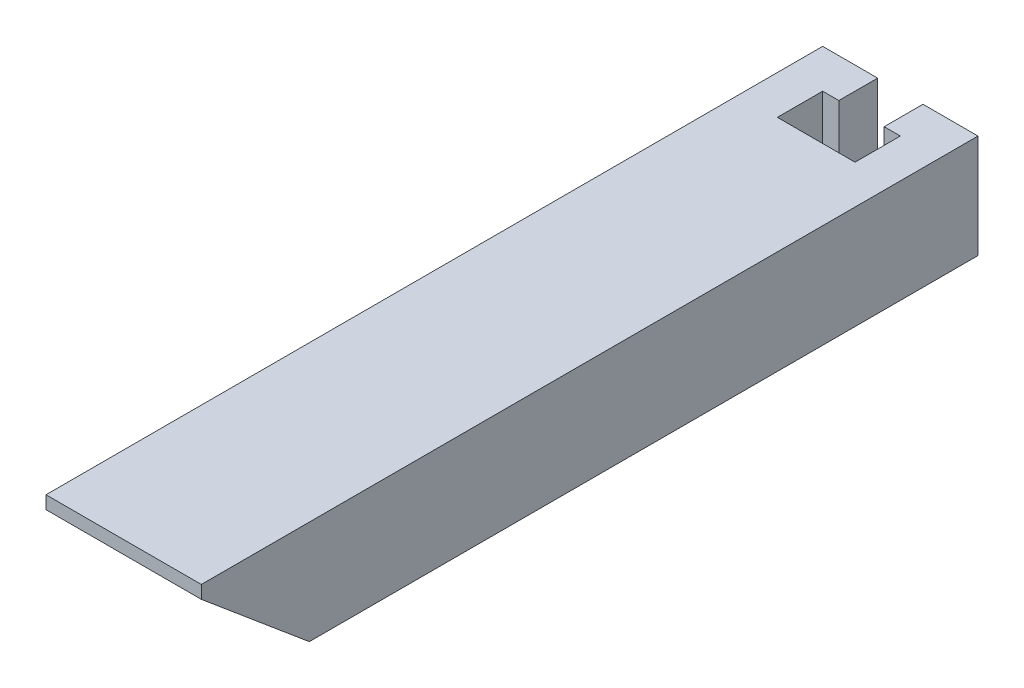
ISO-10303-21;
HEADER;
FILE_DESCRIPTION(('STEP AP214'),'2;1');
FILE_NAME('part.step','',(''),(''),'','','');
FILE_SCHEMA(('AUTOMOTIVE_DESIGN { 1 0 10303 214 1 1 1 1 }'));
ENDSEC;
DATA;
#1=APPLICATION_CONTEXT('core data for automotive mechanical design processes');
#2=APPLICATION_PROTOCOL_DEFINITION('international standard','automotive_design',2000,#1);
#3=PRODUCT_CONTEXT('',#1,'mechanical');
#4=PRODUCT('Part','Part','',(#3));
#5=PRODUCT_RELATED_PRODUCT_CATEGORY('part','',(#4));
#6=PRODUCT_DEFINITION_FORMATION('','',#4);
#7=PRODUCT_DEFINITION_CONTEXT('part definition',#1,'design');
#8=PRODUCT_DEFINITION('design','',#6,#7);
#9=PRODUCT_DEFINITION_SHAPE('','',#8);
#10=(LENGTH_UNIT() NAMED_UNIT(*) SI_UNIT(.MILLI.,.METRE.));
#11=(NAMED_UNIT(*) PLANE_ANGLE_UNIT() SI_UNIT($,.RADIAN.));
#12=(NAMED_UNIT(*) SI_UNIT($,.STERADIAN.) SOLID_ANGLE_UNIT());
#13=UNCERTAINTY_MEASURE_WITH_UNIT(LENGTH_MEASURE(1.E-05),#10,'distance_accuracy_value','');
#14=(GEOMETRIC_REPRESENTATION_CONTEXT(3) GLOBAL_UNCERTAINTY_ASSIGNED_CONTEXT((#13)) GLOBAL_UNIT_ASSIGNED_CONTEXT((#10,
#11,#12)) REPRESENTATION_CONTEXT('',''));
#15=CARTESIAN_POINT('',(0.,0.,0.));
#16=DIRECTION('',(0.,0.,1.));
#17=DIRECTION('',(1.,0.,0.));
#18=AXIS2_PLACEMENT_3D('',#15,#16,#17);
#19=CARTESIAN_POINT('',(0.,0.,60.));
#20=DIRECTION('',(0.,1.,0.));
#21=DIRECTION('',(0.,0.,1.));
#22=AXIS2_PLACEMENT_3D('',#19,#20,#21);
#23=PLANE('',#22);
#24=DIRECTION('',(6.06285854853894E-13,0.,-1.));
#25=VECTOR('',#24,1.);
#26=CARTESIAN_POINT('',(4.24999999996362,0.,60.0000000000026));
#27=LINE('',#26,#25);
#28=CARTESIAN_POINT('',(4.24999999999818,0.,3.));
#29=VERTEX_POINT('',#28);
#30=CARTESIAN_POINT('',(4.25,0.,0.));
#31=VERTEX_POINT('',#30);
#32=EDGE_CURVE('E175',#29,#31,#27,.T.);
#33=ORIENTED_EDGE('',*,*,#32,.F.);
#34=DIRECTION('',(1.,0.,0.));
#35=VECTOR('',#34,1.);
#36=CARTESIAN_POINT('',(0.,0.,3.));
#37=LINE('',#36,#35);
#38=CARTESIAN_POINT('',(3.,0.,3.));
#39=VERTEX_POINT('',#38);
#40=EDGE_CURVE('E185',#39,#29,#37,.T.);
#41=ORIENTED_EDGE('',*,*,#40,.F.);
#42=DIRECTION('',(0.,0.,-1.));
#43=VECTOR('',#42,1.);
#44=CARTESIAN_POINT('',(3.,0.,60.));
#45=LINE('',#44,#43);
#46=CARTESIAN_POINT('',(3.,0.,6.5));
#47=VERTEX_POINT('',#46);
#48=EDGE_CURVE('E183',#47,#39,#45,.T.);
#49=ORIENTED_EDGE('',*,*,#48,.F.);
#50=DIRECTION('',(-1.,0.,0.));
#51=VECTOR('',#50,1.);
#52=CARTESIAN_POINT('',(0.,0.,6.5));
#53=LINE('',#52,#51);
#54=CARTESIAN_POINT('',(9.,0.,6.5));
#55=VERTEX_POINT('',#54);
#56=EDGE_CURVE('E181',#55,#47,#53,.T.);
#57=ORIENTED_EDGE('',*,*,#56,.F.);
#58=DIRECTION('',(0.,0.,1.));
#59=VECTOR('',#58,1.);
#60=CARTESIAN_POINT('',(9.,0.,60.));
#61=LINE('',#60,#59);
#62=CARTESIAN_POINT('',(9.,0.,3.));
#63=VERTEX_POINT('',#62);
#64=EDGE_CURVE('E179',#63,#55,#61,.T.);
#65=ORIENTED_EDGE('',*,*,#64,.F.);
#66=DIRECTION('',(1.,0.,0.));
#67=VECTOR('',#66,1.);
#68=CARTESIAN_POINT('',(0.,0.,3.));
#69=LINE('',#68,#67);
#70=CARTESIAN_POINT('',(7.75,0.,3.));
#71=VERTEX_POINT('',#70);
#72=EDGE_CURVE('E177',#71,#63,#69,.T.);
#73=ORIENTED_EDGE('',*,*,#72,.F.);
#74=DIRECTION('',(0.,0.,1.));
#75=VECTOR('',#74,1.);
#76=CARTESIAN_POINT('',(7.75,0.,60.));
#77=LINE('',#76,#75);
#78=CARTESIAN_POINT('',(7.75,0.,0.));
#79=VERTEX_POINT('',#78);
#80=EDGE_CURVE('E131',#79,#71,#77,.T.);
#81=ORIENTED_EDGE('',*,*,#80,.F.);
#82=DIRECTION('',(1.,0.,0.));
#83=VECTOR('',#82,1.);
#84=CARTESIAN_POINT('',(0.,0.,0.));
#85=LINE('',#84,#83);
#86=CARTESIAN_POINT('',(12.,0.,0.));
#87=VERTEX_POINT('',#86);
#88=EDGE_CURVE('E203',#79,#87,#85,.T.);
#89=ORIENTED_EDGE('',*,*,#88,.T.);
#90=DIRECTION('',(0.,0.,-1.));
#91=VECTOR('',#90,1.);
#92=CARTESIAN_POINT('',(12.,0.,60.));
#93=LINE('',#92,#91);
#94=CARTESIAN_POINT('',(12.,-1.13583191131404E-13,51.6577248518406));
#95=VERTEX_POINT('',#94);
#96=EDGE_CURVE('E215',#95,#87,#93,.T.);
#97=ORIENTED_EDGE('',*,*,#96,.F.);
#98=DIRECTION('',(1.,0.,0.));
#99=VECTOR('',#98,1.);
#100=CARTESIAN_POINT('',(-48.,-1.13686837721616E-13,51.6577248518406));
#101=LINE('',#100,#99);
#102=CARTESIAN_POINT('',(0.,-1.13686837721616E-13,51.6577248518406));
#103=VERTEX_POINT('',#102);
#104=EDGE_CURVE('E188',#103,#95,#101,.T.);
#105=ORIENTED_EDGE('',*,*,#104,.F.);
#106=DIRECTION('',(0.,0.,-1.));
#107=VECTOR('',#106,1.);
#108=CARTESIAN_POINT('',(0.,0.,60.));
#109=LINE('',#108,#107);
#110=CARTESIAN_POINT('',(0.,0.,0.));
#111=VERTEX_POINT('',#110);
#112=EDGE_CURVE('E218',#103,#111,#109,.T.);
#113=ORIENTED_EDGE('',*,*,#112,.T.);
#114=EDGE_CURVE('E204',#111,#31,#85,.T.);
#115=ORIENTED_EDGE('',*,*,#114,.T.);
#116=EDGE_LOOP('',(#33,#41,#49,#57,#65,#73,#81,#89,#97,#105,#113,#115));
#117=FACE_BOUND('',#116,.T.);
#118=ADVANCED_FACE('F34',(#117),#23,.F.);
#119=CARTESIAN_POINT('',(0.,8.,60.));
#120=DIRECTION('',(0.,-1.,0.));
#121=DIRECTION('',(0.,0.,-1.));
#122=AXIS2_PLACEMENT_3D('',#119,#120,#121);
#123=PLANE('',#122);
#124=DIRECTION('',(6.06285854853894E-13,0.,-1.));
#125=VECTOR('',#124,1.);
#126=CARTESIAN_POINT('',(4.24999999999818,8.,3.));
#127=LINE('',#126,#125);
#128=CARTESIAN_POINT('',(4.24999999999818,8.,3.));
#129=VERTEX_POINT('',#128);
#130=CARTESIAN_POINT('',(4.25,8.,0.));
#131=VERTEX_POINT('',#130);
#132=EDGE_CURVE('E135',#129,#131,#127,.T.);
#133=ORIENTED_EDGE('',*,*,#132,.T.);
#134=DIRECTION('',(-1.,0.,0.));
#135=VECTOR('',#134,1.);
#136=CARTESIAN_POINT('',(0.,8.,0.));
#137=LINE('',#136,#135);
#138=CARTESIAN_POINT('',(0.,8.,0.));
#139=VERTEX_POINT('',#138);
#140=EDGE_CURVE('E209',#131,#139,#137,.T.);
#141=ORIENTED_EDGE('',*,*,#140,.T.);
#142=DIRECTION('',(0.,0.,-1.));
#143=VECTOR('',#142,1.);
#144=CARTESIAN_POINT('',(0.,8.,60.));
#145=LINE('',#144,#143);
#146=CARTESIAN_POINT('',(0.,8.,60.));
#147=VERTEX_POINT('',#146);
#148=EDGE_CURVE('E200',#147,#139,#145,.T.);
#149=ORIENTED_EDGE('',*,*,#148,.F.);
#150=DIRECTION('',(-1.,0.,0.));
#151=VECTOR('',#150,1.);
#152=CARTESIAN_POINT('',(0.,8.,60.));
#153=LINE('',#152,#151);
#154=CARTESIAN_POINT('',(12.,8.,60.));
#155=VERTEX_POINT('',#154);
#156=EDGE_CURVE('E198',#155,#147,#153,.T.);
#157=ORIENTED_EDGE('',*,*,#156,.F.);
#158=DIRECTION('',(0.,0.,-1.));
#159=VECTOR('',#158,1.);
#160=CARTESIAN_POINT('',(12.,8.,60.));
#161=LINE('',#160,#159);
#162=CARTESIAN_POINT('',(12.,8.,0.));
#163=VERTEX_POINT('',#162);
#164=EDGE_CURVE('E213',#155,#163,#161,.T.);
#165=ORIENTED_EDGE('',*,*,#164,.T.);
#166=CARTESIAN_POINT('',(7.75,8.,0.));
#167=VERTEX_POINT('',#166);
#168=EDGE_CURVE('E151',#163,#167,#137,.T.);
#169=ORIENTED_EDGE('',*,*,#168,.T.);
#170=DIRECTION('',(0.,0.,1.));
#171=VECTOR('',#170,1.);
#172=CARTESIAN_POINT('',(7.75,8.,3.));
#173=LINE('',#172,#171);
#174=CARTESIAN_POINT('',(7.75,8.,3.));
#175=VERTEX_POINT('',#174);
#176=EDGE_CURVE('E49',#167,#175,#173,.T.);
#177=ORIENTED_EDGE('',*,*,#176,.T.);
#178=DIRECTION('',(1.,0.,0.));
#179=VECTOR('',#178,1.);
#180=CARTESIAN_POINT('',(7.75,8.,3.));
#181=LINE('',#180,#179);
#182=CARTESIAN_POINT('',(9.,8.,3.));
#183=VERTEX_POINT('',#182);
#184=EDGE_CURVE('E138',#175,#183,#181,.T.);
#185=ORIENTED_EDGE('',*,*,#184,.T.);
#186=DIRECTION('',(0.,0.,1.));
#187=VECTOR('',#186,1.);
#188=CARTESIAN_POINT('',(9.,8.,6.5));
#189=LINE('',#188,#187);
#190=CARTESIAN_POINT('',(9.,8.,6.5));
#191=VERTEX_POINT('',#190);
#192=EDGE_CURVE('E144',#183,#191,#189,.T.);
#193=ORIENTED_EDGE('',*,*,#192,.T.);
#194=DIRECTION('',(-1.,0.,0.));
#195=VECTOR('',#194,1.);
#196=CARTESIAN_POINT('',(3.,8.,6.5));
#197=LINE('',#196,#195);
#198=CARTESIAN_POINT('',(3.,8.,6.5));
#199=VERTEX_POINT('',#198);
#200=EDGE_CURVE('E155',#191,#199,#197,.T.);
#201=ORIENTED_EDGE('',*,*,#200,.T.);
#202=DIRECTION('',(0.,0.,-1.));
#203=VECTOR('',#202,1.);
#204=CARTESIAN_POINT('',(3.,8.,6.5));
#205=LINE('',#204,#203);
#206=CARTESIAN_POINT('',(3.,8.,3.));
#207=VERTEX_POINT('',#206);
#208=EDGE_CURVE('E158',#199,#207,#205,.T.);
#209=ORIENTED_EDGE('',*,*,#208,.T.);
#210=DIRECTION('',(1.,0.,0.));
#211=VECTOR('',#210,1.);
#212=CARTESIAN_POINT('',(3.,8.,3.));
#213=LINE('',#212,#211);
#214=EDGE_CURVE('E161',#207,#129,#213,.T.);
#215=ORIENTED_EDGE('',*,*,#214,.T.);
#216=EDGE_LOOP('',(#133,#141,#149,#157,#165,#169,#177,#185,#193,#201,#209,#215));
#217=FACE_BOUND('',#216,.T.);
#218=ADVANCED_FACE('F148',(#217),#123,.F.);
#219=CARTESIAN_POINT('',(0.,8.,0.));
#220=DIRECTION('',(0.,0.,-1.));
#221=DIRECTION('',(-1.,0.,0.));
#222=AXIS2_PLACEMENT_3D('',#219,#220,#221);
#223=PLANE('',#222);
#224=ORIENTED_EDGE('',*,*,#140,.F.);
#225=DIRECTION('',(0.,-1.,0.));
#226=VECTOR('',#225,1.);
#227=CARTESIAN_POINT('',(4.25,8.,0.));
#228=LINE('',#227,#226);
#229=EDGE_CURVE('E12',#131,#31,#228,.T.);
#230=ORIENTED_EDGE('',*,*,#229,.T.);
#231=ORIENTED_EDGE('',*,*,#114,.F.);
#232=DIRECTION('',(0.,-1.,0.));
#233=VECTOR('',#232,1.);
#234=CARTESIAN_POINT('',(0.,0.,0.));
#235=LINE('',#234,#233);
#236=EDGE_CURVE('E192',#139,#111,#235,.T.);
#237=ORIENTED_EDGE('',*,*,#236,.F.);
#238=EDGE_LOOP('',(#224,#230,#231,#237));
#239=FACE_BOUND('',#238,.T.);
#240=ADVANCED_FACE('F253',(#239),#223,.T.);
#241=ORIENTED_EDGE('',*,*,#88,.F.);
#242=DIRECTION('',(0.,1.,0.));
#243=VECTOR('',#242,1.);
#244=CARTESIAN_POINT('',(7.75,8.,0.));
#245=LINE('',#244,#243);
#246=EDGE_CURVE('E42',#79,#167,#245,.T.);
#247=ORIENTED_EDGE('',*,*,#246,.T.);
#248=ORIENTED_EDGE('',*,*,#168,.F.);
#249=DIRECTION('',(0.,1.,0.));
#250=VECTOR('',#249,1.);
#251=CARTESIAN_POINT('',(12.,0.,0.));
#252=LINE('',#251,#250);
#253=EDGE_CURVE('E207',#87,#163,#252,.T.);
#254=ORIENTED_EDGE('',*,*,#253,.F.);
#255=EDGE_LOOP('',(#241,#247,#248,#254));
#256=FACE_BOUND('',#255,.T.);
#257=ADVANCED_FACE('F223',(#256),#223,.T.);
#258=CARTESIAN_POINT('',(0.,0.,60.));
#259=DIRECTION('',(1.,0.,0.));
#260=DIRECTION('',(0.,0.,-1.));
#261=AXIS2_PLACEMENT_3D('',#258,#259,#260);
#262=PLANE('',#261);
#263=DIRECTION('',(0.,-0.642787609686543,-0.766044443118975));
#264=VECTOR('',#263,1.);
#265=CARTESIAN_POINT('',(0.,4.10776862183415,56.5531728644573));
#266=LINE('',#265,#264);
#267=CARTESIAN_POINT('',(0.,6.99999999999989,60.));
#268=VERTEX_POINT('',#267);
#269=EDGE_CURVE('E190',#268,#103,#266,.T.);
#270=ORIENTED_EDGE('',*,*,#269,.F.);
#271=DIRECTION('',(0.,-1.,0.));
#272=VECTOR('',#271,1.);
#273=CARTESIAN_POINT('',(0.,0.,60.));
#274=LINE('',#273,#272);
#275=EDGE_CURVE('E193',#147,#268,#274,.T.);
#276=ORIENTED_EDGE('',*,*,#275,.F.);
#277=ORIENTED_EDGE('',*,*,#148,.T.);
#278=ORIENTED_EDGE('',*,*,#236,.T.);
#279=ORIENTED_EDGE('',*,*,#112,.F.);
#280=EDGE_LOOP('',(#270,#276,#277,#278,#279));
#281=FACE_BOUND('',#280,.T.);
#282=ADVANCED_FACE('F36',(#281),#262,.F.);
#283=CARTESIAN_POINT('',(12.,0.,60.));
#284=DIRECTION('',(-1.,0.,0.));
#285=DIRECTION('',(0.,0.,1.));
#286=AXIS2_PLACEMENT_3D('',#283,#284,#285);
#287=PLANE('',#286);
#288=DIRECTION('',(0.,-0.642787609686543,-0.766044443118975));
#289=VECTOR('',#288,1.);
#290=CARTESIAN_POINT('',(12.,6.99999999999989,60.));
#291=LINE('',#290,#289);
#292=CARTESIAN_POINT('',(12.,6.99999999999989,60.));
#293=VERTEX_POINT('',#292);
#294=EDGE_CURVE('E57',#293,#95,#291,.T.);
#295=ORIENTED_EDGE('',*,*,#294,.T.);
#296=ORIENTED_EDGE('',*,*,#96,.T.);
#297=ORIENTED_EDGE('',*,*,#253,.T.);
#298=ORIENTED_EDGE('',*,*,#164,.F.);
#299=DIRECTION('',(0.,1.,0.));
#300=VECTOR('',#299,1.);
#301=CARTESIAN_POINT('',(12.,0.,60.));
#302=LINE('',#301,#300);
#303=EDGE_CURVE('E196',#293,#155,#302,.T.);
#304=ORIENTED_EDGE('',*,*,#303,.F.);
#305=EDGE_LOOP('',(#295,#296,#297,#298,#304));
#306=FACE_BOUND('',#305,.T.);
#307=ADVANCED_FACE('F265',(#306),#287,.F.);
#308=CARTESIAN_POINT('',(0.,8.,60.));
#309=DIRECTION('',(0.,0.,-1.));
#310=DIRECTION('',(-1.,0.,0.));
#311=AXIS2_PLACEMENT_3D('',#308,#309,#310);
#312=PLANE('',#311);
#313=DIRECTION('',(-1.,0.,0.));
#314=VECTOR('',#313,1.);
#315=CARTESIAN_POINT('',(0.,6.99999999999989,60.));
#316=LINE('',#315,#314);
#317=EDGE_CURVE('E220',#293,#268,#316,.T.);
#318=ORIENTED_EDGE('',*,*,#317,.F.);
#319=ORIENTED_EDGE('',*,*,#303,.T.);
#320=ORIENTED_EDGE('',*,*,#156,.T.);
#321=ORIENTED_EDGE('',*,*,#275,.T.);
#322=EDGE_LOOP('',(#318,#319,#320,#321));
#323=FACE_BOUND('',#322,.T.);
#324=ADVANCED_FACE('F262',(#323),#312,.F.);
#325=CARTESIAN_POINT('',(-48.,6.99999999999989,60.));
#326=DIRECTION('',(0.,-0.766044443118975,0.642787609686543));
#327=DIRECTION('',(0.,-0.642787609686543,-0.766044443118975));
#328=AXIS2_PLACEMENT_3D('',#325,#326,#327);
#329=PLANE('',#328);
#330=ORIENTED_EDGE('',*,*,#269,.T.);
#331=ORIENTED_EDGE('',*,*,#104,.T.);
#332=ORIENTED_EDGE('',*,*,#294,.F.);
#333=ORIENTED_EDGE('',*,*,#317,.T.);
#334=EDGE_LOOP('',(#330,#331,#332,#333));
#335=FACE_BOUND('',#334,.T.);
#336=ADVANCED_FACE('F267',(#335),#329,.T.);
#337=CARTESIAN_POINT('',(3.,-52.,3.));
#338=DIRECTION('',(0.,0.,1.));
#339=DIRECTION('',(1.,0.,0.));
#340=AXIS2_PLACEMENT_3D('',#337,#338,#339);
#341=PLANE('',#340);
#342=ORIENTED_EDGE('',*,*,#40,.T.);
#343=DIRECTION('',(0.,1.,0.));
#344=VECTOR('',#343,1.);
#345=CARTESIAN_POINT('',(4.24999999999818,-52.,3.));
#346=LINE('',#345,#344);
#347=EDGE_CURVE('E165',#29,#129,#346,.T.);
#348=ORIENTED_EDGE('',*,*,#347,.T.);
#349=ORIENTED_EDGE('',*,*,#214,.F.);
#350=DIRECTION('',(0.,1.,0.));
#351=VECTOR('',#350,1.);
#352=CARTESIAN_POINT('',(3.,-52.,3.));
#353=LINE('',#352,#351);
#354=EDGE_CURVE('E167',#39,#207,#353,.T.);
#355=ORIENTED_EDGE('',*,*,#354,.F.);
#356=EDGE_LOOP('',(#342,#348,#349,#355));
#357=FACE_BOUND('',#356,.T.);
#358=ADVANCED_FACE('F245',(#357),#341,.T.);
#359=CARTESIAN_POINT('',(3.,-52.,6.5));
#360=DIRECTION('',(1.,0.,0.));
#361=DIRECTION('',(0.,0.,-1.));
#362=AXIS2_PLACEMENT_3D('',#359,#360,#361);
#363=PLANE('',#362);
#364=ORIENTED_EDGE('',*,*,#48,.T.);
#365=ORIENTED_EDGE('',*,*,#354,.T.);
#366=ORIENTED_EDGE('',*,*,#208,.F.);
#367=DIRECTION('',(0.,1.,0.));
#368=VECTOR('',#367,1.);
#369=CARTESIAN_POINT('',(3.,-52.,6.5));
#370=LINE('',#369,#368);
#371=EDGE_CURVE('E169',#47,#199,#370,.T.);
#372=ORIENTED_EDGE('',*,*,#371,.F.);
#373=EDGE_LOOP('',(#364,#365,#366,#372));
#374=FACE_BOUND('',#373,.T.);
#375=ADVANCED_FACE('F240',(#374),#363,.T.);
#376=CARTESIAN_POINT('',(3.,-52.,6.5));
#377=DIRECTION('',(0.,0.,-1.));
#378=DIRECTION('',(-1.,0.,0.));
#379=AXIS2_PLACEMENT_3D('',#376,#377,#378);
#380=PLANE('',#379);
#381=ORIENTED_EDGE('',*,*,#56,.T.);
#382=ORIENTED_EDGE('',*,*,#371,.T.);
#383=ORIENTED_EDGE('',*,*,#200,.F.);
#384=DIRECTION('',(0.,1.,0.));
#385=VECTOR('',#384,1.);
#386=CARTESIAN_POINT('',(9.,-52.,6.5));
#387=LINE('',#386,#385);
#388=EDGE_CURVE('E171',#55,#191,#387,.T.);
#389=ORIENTED_EDGE('',*,*,#388,.F.);
#390=EDGE_LOOP('',(#381,#382,#383,#389));
#391=FACE_BOUND('',#390,.T.);
#392=ADVANCED_FACE('F236',(#391),#380,.T.);
#393=CARTESIAN_POINT('',(9.,-52.,6.5));
#394=DIRECTION('',(-1.,0.,0.));
#395=DIRECTION('',(0.,0.,1.));
#396=AXIS2_PLACEMENT_3D('',#393,#394,#395);
#397=PLANE('',#396);
#398=ORIENTED_EDGE('',*,*,#64,.T.);
#399=ORIENTED_EDGE('',*,*,#388,.T.);
#400=ORIENTED_EDGE('',*,*,#192,.F.);
#401=DIRECTION('',(0.,1.,0.));
#402=VECTOR('',#401,1.);
#403=CARTESIAN_POINT('',(9.,-52.,3.));
#404=LINE('',#403,#402);
#405=EDGE_CURVE('E134',#63,#183,#404,.T.);
#406=ORIENTED_EDGE('',*,*,#405,.F.);
#407=EDGE_LOOP('',(#398,#399,#400,#406));
#408=FACE_BOUND('',#407,.T.);
#409=ADVANCED_FACE('F231',(#408),#397,.T.);
#410=CARTESIAN_POINT('',(7.75,-52.,3.));
#411=DIRECTION('',(0.,0.,1.));
#412=DIRECTION('',(1.,0.,0.));
#413=AXIS2_PLACEMENT_3D('',#410,#411,#412);
#414=PLANE('',#413);
#415=ORIENTED_EDGE('',*,*,#72,.T.);
#416=ORIENTED_EDGE('',*,*,#405,.T.);
#417=ORIENTED_EDGE('',*,*,#184,.F.);
#418=DIRECTION('',(0.,1.,0.));
#419=VECTOR('',#418,1.);
#420=CARTESIAN_POINT('',(7.75,-52.,3.));
#421=LINE('',#420,#419);
#422=EDGE_CURVE('E127',#71,#175,#421,.T.);
#423=ORIENTED_EDGE('',*,*,#422,.F.);
#424=EDGE_LOOP('',(#415,#416,#417,#423));
#425=FACE_BOUND('',#424,.T.);
#426=ADVANCED_FACE('F139',(#425),#414,.T.);
#427=CARTESIAN_POINT('',(4.24999999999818,-52.,3.));
#428=DIRECTION('',(1.,0.,6.06285854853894E-13));
#429=DIRECTION('',(6.06285854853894E-13,0.,-1.));
#430=AXIS2_PLACEMENT_3D('',#427,#428,#429);
#431=PLANE('',#430);
#432=ORIENTED_EDGE('',*,*,#32,.T.);
#433=ORIENTED_EDGE('',*,*,#229,.F.);
#434=ORIENTED_EDGE('',*,*,#132,.F.);
#435=ORIENTED_EDGE('',*,*,#347,.F.);
#436=EDGE_LOOP('',(#432,#433,#434,#435));
#437=FACE_BOUND('',#436,.T.);
#438=ADVANCED_FACE('F363',(#437),#431,.T.);
#439=CARTESIAN_POINT('',(7.75,-52.,3.));
#440=DIRECTION('',(-1.,0.,0.));
#441=DIRECTION('',(0.,0.,1.));
#442=AXIS2_PLACEMENT_3D('',#439,#440,#441);
#443=PLANE('',#442);
#444=ORIENTED_EDGE('',*,*,#80,.T.);
#445=ORIENTED_EDGE('',*,*,#422,.T.);
#446=ORIENTED_EDGE('',*,*,#176,.F.);
#447=ORIENTED_EDGE('',*,*,#246,.F.);
#448=EDGE_LOOP('',(#444,#445,#446,#447));
#449=FACE_BOUND('',#448,.T.);
#450=ADVANCED_FACE('F129',(#449),#443,.T.);
#451=CLOSED_SHELL('',(#118,#218,#240,#257,#282,#307,#324,#336,#358,#375,#392,#409,#426,#438,#450));
#452=MANIFOLD_SOLID_BREP('B2',#451);
#453=ADVANCED_BREP_SHAPE_REPRESENTATION('',(#18,#452),#14);
#454=SHAPE_DEFINITION_REPRESENTATION(#9,#453);
ENDSEC;
END-ISO-10303-21;
